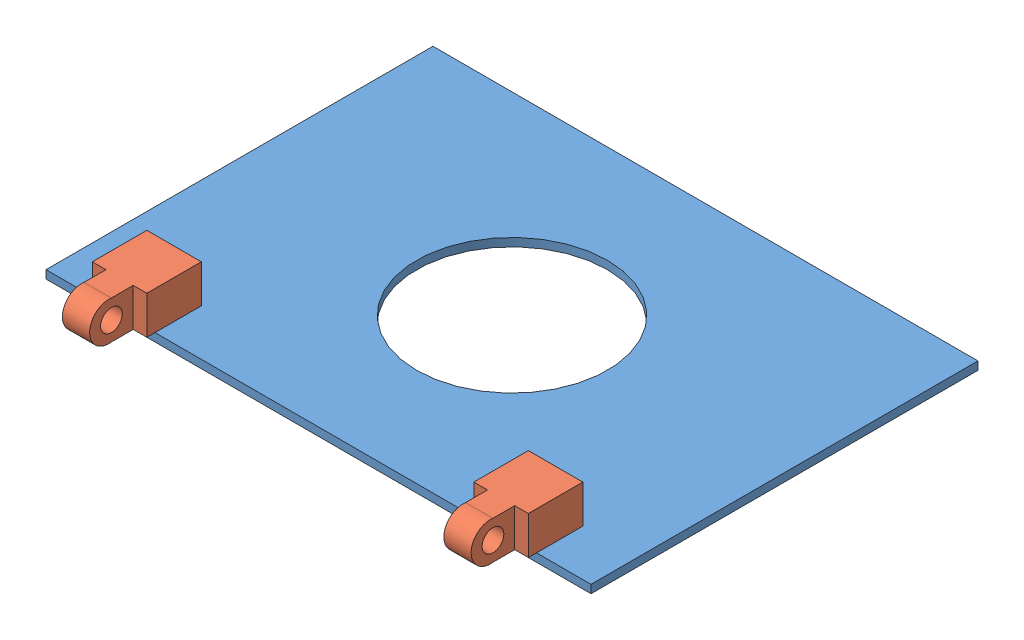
SolidWorks assembly Assemblage3.SLDASM, configuration Défaut (file format 10000). Lengths in mm.
Overall size (100 8.53 81.03).
5 component instances, 3 part files, 12 mates.
Components (placement in the parent):
- 2-plaque-1: 2-plaque.SLDPRT [Défaut] at (-87.8092 0.522 137.5) size (100 1.5 71)
- CHARNIERRE 2-1: CHARNIERRE 2.SLDPRT [Défaut] at (-66.3092 2.022 137.5) x (0 0 -1) z (1 0 0) (suppressed, hidden)
- CHARNIERRE 2-2: CHARNIERRE 2.SLDPRT [Défaut] at (3.6908 2.022 137.5) x (0 0 -1) z (1 0 0) (suppressed, hidden)
- 7-CHARNIERE 2-1: 7-CHARNIERE 2.SLDPRT [Défaut] at (3.6908 2.022 137.5) x (0 0 -1) z (1 0 0) size (18.53 7.06 10)
- 7-CHARNIERE 2-2: 7-CHARNIERE 2.SLDPRT [Défaut] at (-66.3092 2.022 137.5) x (0 0 -1) z (1 0 0) size (18.53 7.06 10)
Mates (geometry in assembly coordinates):
- Coïncidente1: coincident: point of 2-plaque-1; point of CHARNIERRE 2-1
- Coïncidente3: coincident: point of 2-plaque-1; point of CHARNIERRE 2-1
- Coïncidente4: coincident anti-aligned: plane of 2-plaque-1 through (-87.8092 2.022 137.5) normal (0 1 0); plane of CHARNIERRE 2-1 through (-66.3092 2.022 137.5) normal (0 -1 0)
- Coïncidente5: coincident: point of 2-plaque-1; point of CHARNIERRE 2-2
- Coïncidente6: coincident: point of 2-plaque-1; point of CHARNIERRE 2-2
- Coïncidente7: coincident anti-aligned: plane of 2-plaque-1 through (-87.8092 2.022 137.5) normal (0 1 0); plane of CHARNIERRE 2-2 through (3.6908 2.022 137.5) normal (0 -1 0)
- Coïncidente10: coincident: point of 2-plaque-1; point of 7-CHARNIERE 2-1
- Coïncidente12: coincident: point of 2-plaque-1; point of 7-CHARNIERE 2-1
- Coïncidente13: coincident anti-aligned: plane of 2-plaque-1 through (-87.8092 2.022 137.5) normal (0 1 0); plane of 7-CHARNIERE 2-1 through (3.6908 2.022 137.5) normal (0 -1 0)
- Coïncidente14: coincident: point of 2-plaque-1; point of 7-CHARNIERE 2-2
- Coïncidente15: coincident: point of 2-plaque-1; point of 7-CHARNIERE 2-2
- Coïncidente16: coincident anti-aligned: plane of 2-plaque-1 through (-87.8092 2.022 137.5) normal (0 1 0); plane of 7-CHARNIERE 2-2 through (-66.3092 2.022 137.5) normal (0 -1 0)
